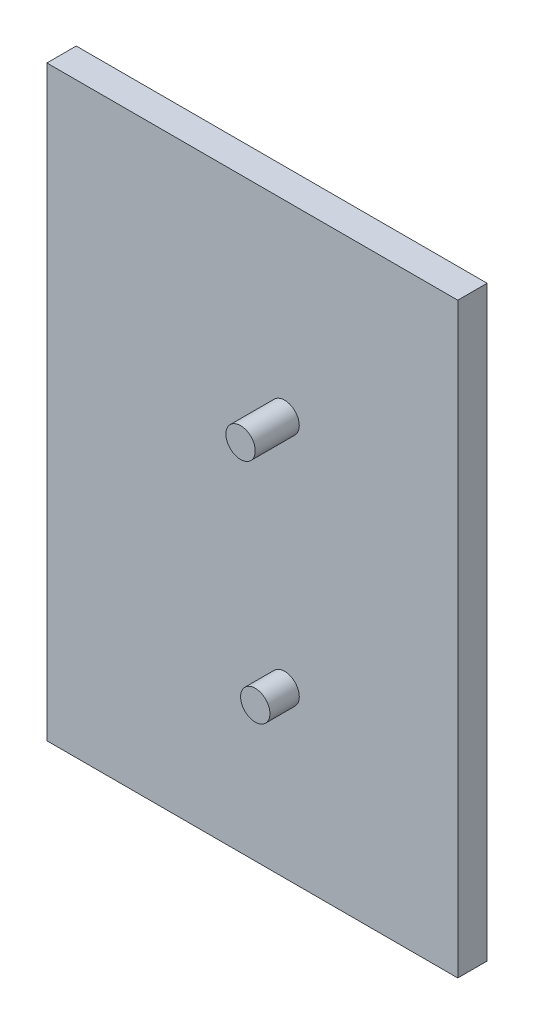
from build123d import *

# Parameters (mm, degrees)
BOSS_EXTRUDE1_DEPTH = 50
SKETCH2_R           = 25
BOSS_EXTRUDE2_DEPTH = 75
SKETCH3_R           = 25
BOSS_EXTRUDE3_DEPTH = 50


with BuildPart() as part:
    # Sketch1 → Boss-Extrude1 (new body)
    with BuildSketch(Plane.XY.offset(-62.5)):
        Polygon((-397.999998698, -276.999997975), (302.000001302, -277.000012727), (302.000022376, 722.999987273), (-397.999977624, 723.000002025), align=None)
    extrude(amount=-BOSS_EXTRUDE1_DEPTH)

    # Sketch2 → Boss-Extrude2 (add)
    with BuildSketch(Plane.XY.offset(-62.5)):
        with Locations((7.000015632, 402.99999349)):
            Circle(SKETCH2_R)
    extrude(amount=BOSS_EXTRUDE2_DEPTH)

    # Sketch3 → Boss-Extrude3 (add)
    with BuildSketch(Plane.XY.offset(-62.5)):
        with Locations((7.000007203, 2.99999349)):
            Circle(SKETCH3_R)
    extrude(amount=BOSS_EXTRUDE3_DEPTH)


solid = part.part
